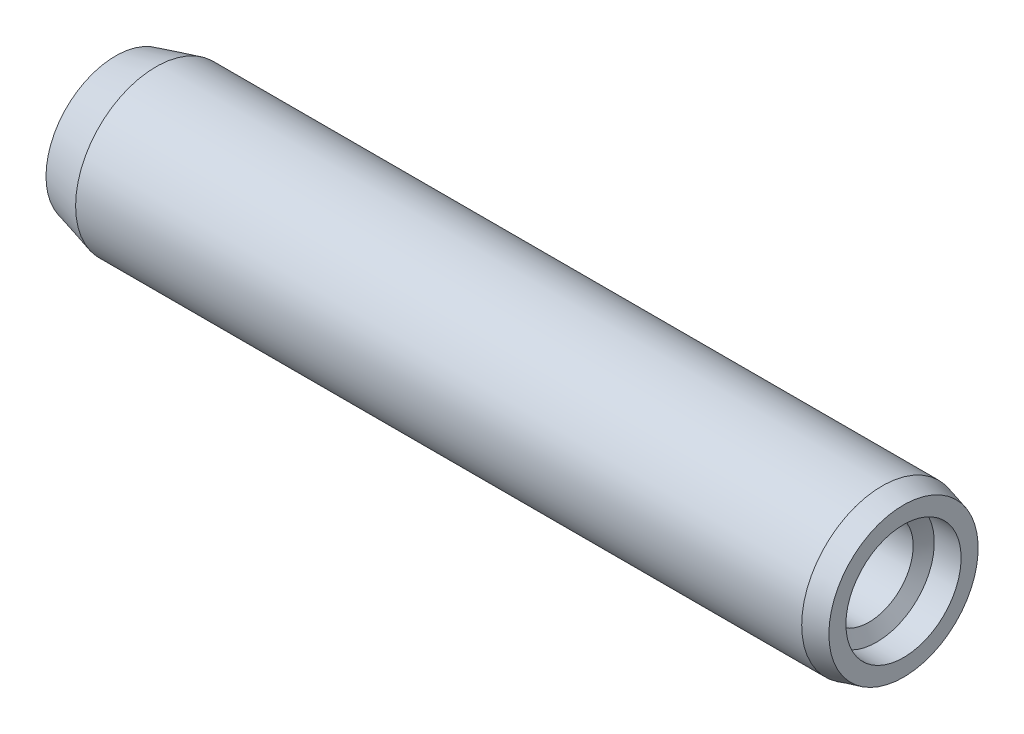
from build123d import *


with BuildPart() as part:
    # Sketch1 → Base-Revolve (revolve)
    with BuildSketch(Plane.XY, mode=Mode.PRIVATE) as base_revolve_sk:
        Polygon((0, 0), (0, 2.437306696), (2.1, 3), (29.2, 3), (30, 2.785640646), (30, 2.15), (29, 2.15), (28.711324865, 1.65), (20, 1.65), (19.008579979, 0), align=None)
    revolve(base_revolve_sk.sketch.rotate(Axis((-10, 0, 0), (1, 0, 0)), 90), axis=Axis((-10, 0, 0), (1, 0, 0)))

    # Sketch2 → TypeA (revolve, cut)
    with BuildSketch(Plane.XY, mode=Mode.PRIVATE) as typea_sk:
        with BuildLine():
            Line((0.590443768, 2.595515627), (0.590443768, 8))
            Line((0.590443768, 8), (-5, 8))
            Line((-5, 8), (-5, 0))
            Line((-5, 0), (0, 0))
            ThreePointArc((0, 0), (0.149472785, 1.33091371), (0.590443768, 2.595515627))
        make_face()
    revolve(typea_sk.sketch.rotate(Axis((0, 0, 0), (1, 0, 0)), 180), axis=Axis((0, 0, 0), (1, 0, 0)), mode=Mode.SUBTRACT)


solid = part.part
